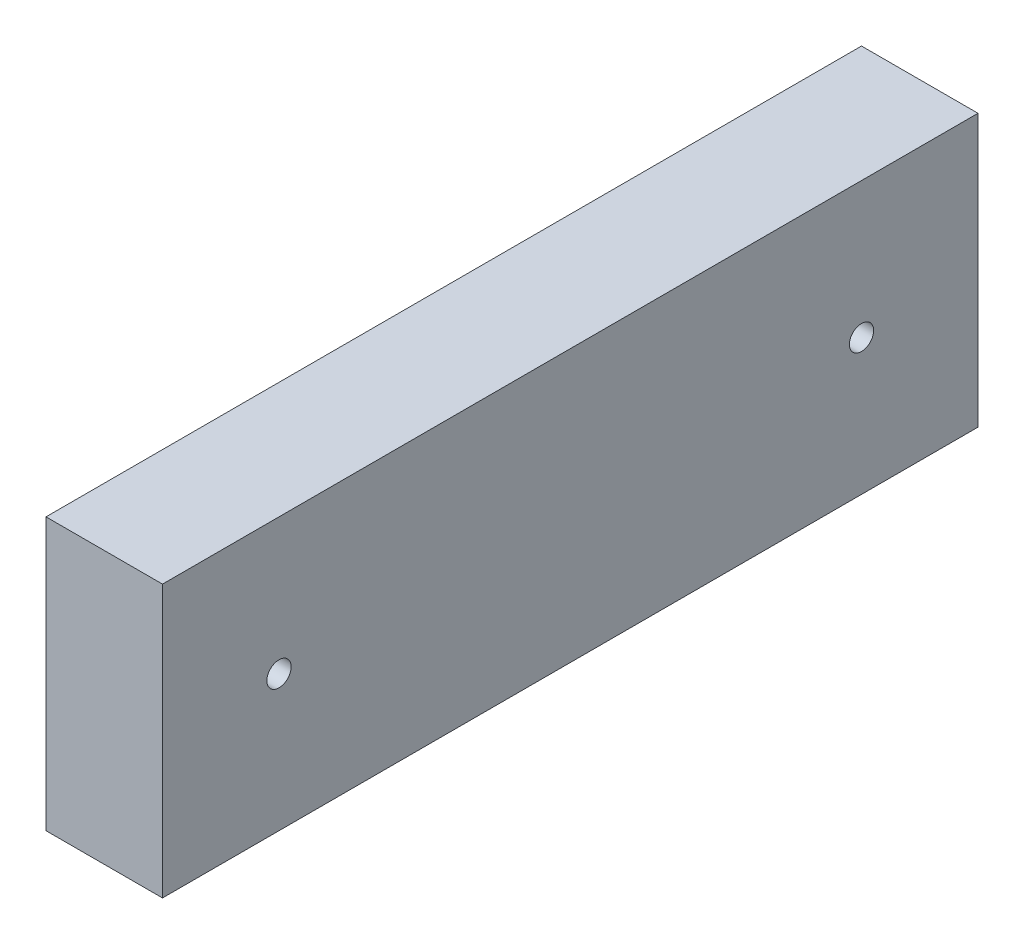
from build123d import *

# Parameters (mm, degrees)
SKETCH1_W                      = 38.1
SKETCH1_H                      = 88.9
BOSS_EXTRUDE1_DEPTH            = 266.7
F_5_16_0_3125_DIAMETER_HOLE1_D = 7.9375


with BuildPart() as part:
    # Sketch1 → Boss-Extrude1 (new body)
    with BuildSketch(Plane.XY):
        Rectangle(SKETCH1_W, SKETCH1_H)
    extrude(amount=BOSS_EXTRUDE1_DEPTH)

    # 5_16 _0.3125_ Diameter Hole1 (through all)
    with Locations(Plane(origin=(19.05, 0, 0), x_dir=(0, 0, -1), z_dir=(1, 0, 0))):
        with Locations((-228.6, 0), (-38.1, 0)):
            Hole(F_5_16_0_3125_DIAMETER_HOLE1_D / 2)


solid = part.part
